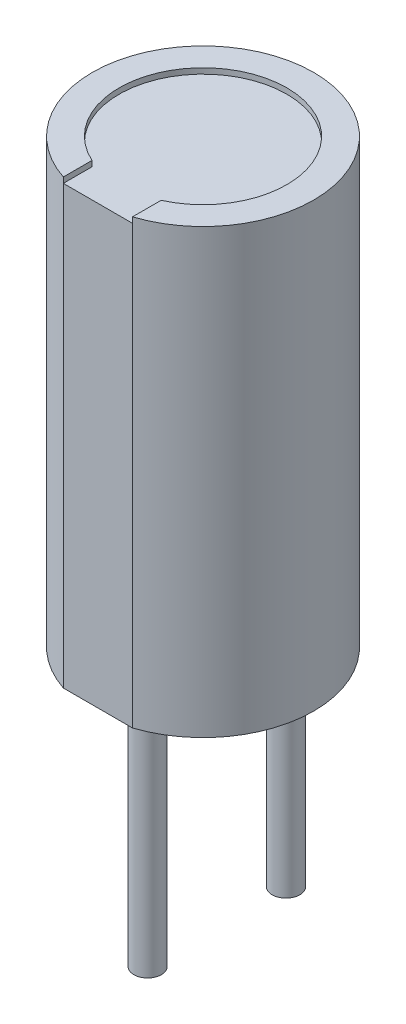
from build123d import *

# Parameters (mm, degrees)
ESQUISSE1_R             = 2
EXTRUSION1_DEPTH        = 8
ESQUISSE2_W             = 2
ESQUISSE2_H             = 8
ENL_V_MAT_EXTRU_1_DEPTH = 0.1
ESQUISSE3_R             = 0.25
EXTRUSION2_DEPTH        = 4.5
ENL_V_MAT_EXTRU_2_DEPTH = 0.1


with BuildPart() as part:
    # Esquisse1 → Extrusion1 (new body)
    with BuildSketch(Plane(origin=(0, 0, 0), x_dir=(1, 0, 0), z_dir=(0, 1, 0))):
        with Locations(Location((0, 0, 0), (0, 0, 270))):
            Circle(ESQUISSE1_R)
    extrude(amount=EXTRUSION1_DEPTH)

    # Esquisse2 → Enl_v. mat.-Extru.1 (cut)
    with BuildSketch(Plane.XY.offset(2)):
        with Locations((0, 4)):
            Rectangle(ESQUISSE2_W, ESQUISSE2_H)
    extrude(amount=-ENL_V_MAT_EXTRU_1_DEPTH, mode=Mode.SUBTRACT)

    # Esquisse3 → Extrusion2 (add)
    with BuildSketch(Plane.XZ):
        with Locations(Location((0, 1, 0), (0, 0, 90))):
            Circle(ESQUISSE3_R)
        with Locations(Location((0, -1.5, 0), (0, 0, 90))):
            Circle(ESQUISSE3_R)
    extrude(amount=EXTRUSION2_DEPTH)

    # Esquisse4 → Enl_v. mat.-Extru.2 (cut)
    with BuildSketch(Plane(origin=(0, 8, 0), x_dir=(-1, 0, 0), z_dir=(0, 1, 0))):
        with BuildLine():
            Line((-0.6244998, 1.38143931), (-0.6244998, 1.9))
            Line((-0.6244998, 1.9), (0.6244998, 1.9))
            Line((0.6244998, 1.9), (0.6244998, 1.38143931))
            ThreePointArc((0.6244998, 1.38143931), (0, -1.516039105), (-0.6244998, 1.38143931))
        make_face()
    extrude(amount=-ENL_V_MAT_EXTRU_2_DEPTH, mode=Mode.SUBTRACT)


solid = part.part
